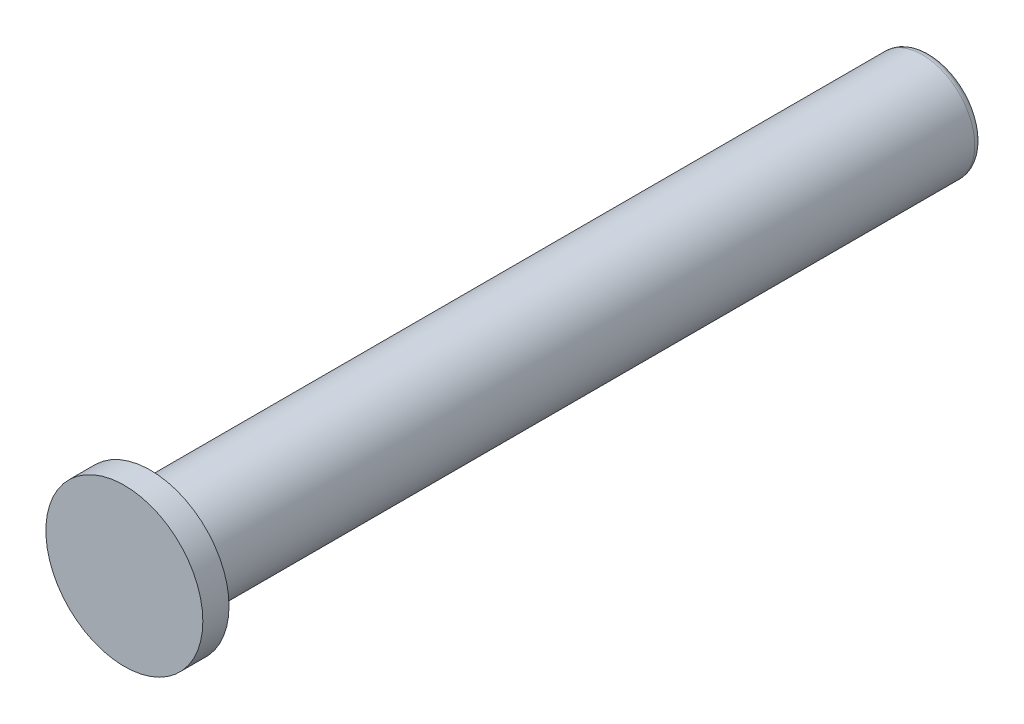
from build123d import *


with BuildPart() as part:
    # Sketch1 → Revolve1 (revolve)
    with BuildSketch(Plane(origin=(0, 0, 0), x_dir=(0, 0, -1), z_dir=(1, 0, 0)), mode=Mode.PRIVATE) as revolve1_sk:
        with BuildLine():
            Line((0, 0), (0, 15))
            Line((0, 15), (5, 15))
            Line((5, 15), (5, 10))
            Line((5, 10), (152.5, 10))
            ThreePointArc((152.5, 10), (153.560660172, 9.560660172), (154, 8.5))
            Line((154, 8.5), (154, 0))
            Line((154, 0), (0, 0))
        make_face()
    revolve(revolve1_sk.sketch.rotate(Axis((0, 0, 0), (0, 0, -1)), 90), axis=Axis((0, 0, 0), (0, 0, -1)))

    # Sketch3 → Cut-Revolve1 (revolve, cut)
    with BuildSketch(Plane(origin=(0, 0, 0), x_dir=(0, 0, -1), z_dir=(1, 0, 0))):
        Polygon((154, 3), (154, 0), (146.989934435, 0), (148, 2.5), (153.5, 2.5), align=None)
    revolve(axis=Axis((0, 0, -154), (0, 0, 1)), mode=Mode.SUBTRACT)


solid = part.part
